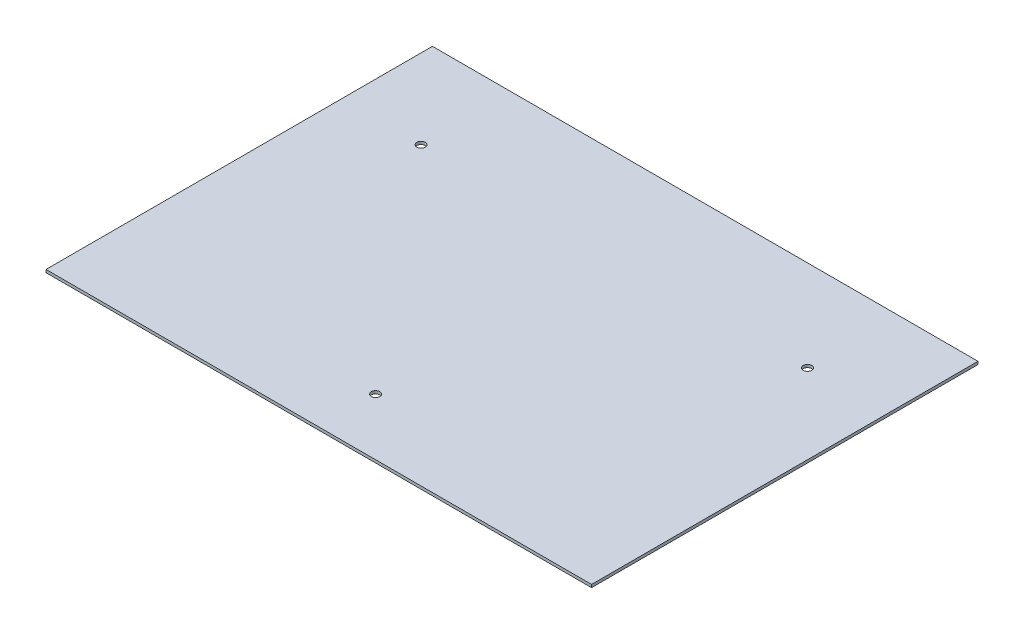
from build123d import *

# Parameters (mm, degrees)
SKETCH1_W           = 609.6
SKETCH1_H           = 431.8
BOSS_EXTRUDE1_DEPTH = 3.175
SKETCH2_R           = 4.7625
CUT_EXTRUDE1_DEPTH  = 374.531699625


with BuildPart() as part:
    # Sketch1 → Boss-Extrude1 (new body)
    with BuildSketch(Plane(origin=(0, 0, 0), x_dir=(1, 0, 0), z_dir=(0, 1, 0))):
        Rectangle(SKETCH1_W, SKETCH1_H)
    extrude(amount=BOSS_EXTRUDE1_DEPTH)

    # Sketch2 → Cut-Extrude1 (cut, through all)
    with BuildSketch(Plane(origin=(0, 3.175, 0), x_dir=(1, 0, 0), z_dir=(0, 1, 0))):
        with Locations(Location((-215.9, 114.3, 0), (0, 0, 270))):
            Circle(SKETCH2_R)
        with Locations(Location((215.9, 114.3, 0), (0, 0, 270))):
            Circle(SKETCH2_R)
        with Locations(Location((0, -152.4, 0), (0, 0, 270))):
            Circle(SKETCH2_R)
    extrude(amount=-CUT_EXTRUDE1_DEPTH, mode=Mode.SUBTRACT)


solid = part.part
